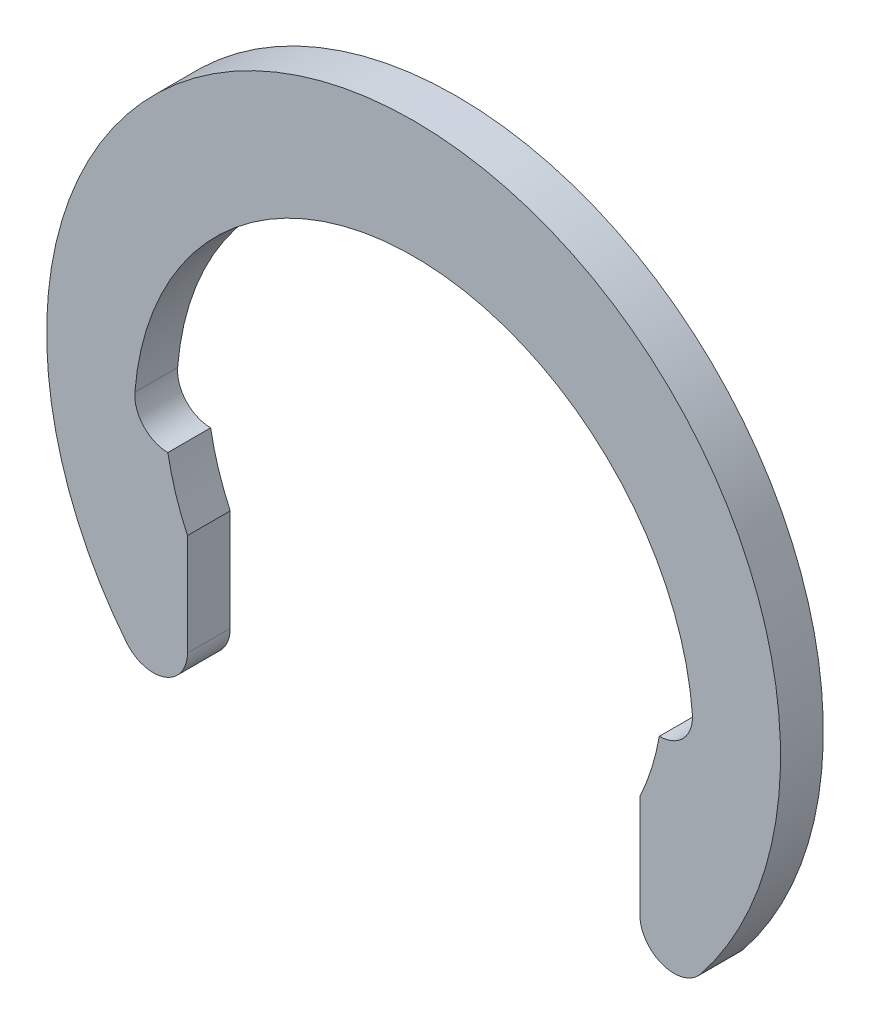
ISO-10303-21;
HEADER;
FILE_DESCRIPTION(('STEP AP214'),'2;1');
FILE_NAME('part.step','',(''),(''),'','','');
FILE_SCHEMA(('AUTOMOTIVE_DESIGN { 1 0 10303 214 1 1 1 1 }'));
ENDSEC;
DATA;
#1=APPLICATION_CONTEXT('core data for automotive mechanical design processes');
#2=APPLICATION_PROTOCOL_DEFINITION('international standard','automotive_design',2000,#1);
#3=PRODUCT_CONTEXT('',#1,'mechanical');
#4=PRODUCT('Part','Part','',(#3));
#5=PRODUCT_RELATED_PRODUCT_CATEGORY('part','',(#4));
#6=PRODUCT_DEFINITION_FORMATION('','',#4);
#7=PRODUCT_DEFINITION_CONTEXT('part definition',#1,'design');
#8=PRODUCT_DEFINITION('design','',#6,#7);
#9=PRODUCT_DEFINITION_SHAPE('','',#8);
#10=(LENGTH_UNIT() NAMED_UNIT(*) SI_UNIT(.MILLI.,.METRE.));
#11=(NAMED_UNIT(*) PLANE_ANGLE_UNIT() SI_UNIT($,.RADIAN.));
#12=(NAMED_UNIT(*) SI_UNIT($,.STERADIAN.) SOLID_ANGLE_UNIT());
#13=UNCERTAINTY_MEASURE_WITH_UNIT(LENGTH_MEASURE(1.E-05),#10,'distance_accuracy_value','');
#14=(GEOMETRIC_REPRESENTATION_CONTEXT(3) GLOBAL_UNCERTAINTY_ASSIGNED_CONTEXT((#13)) GLOBAL_UNIT_ASSIGNED_CONTEXT((#10,
#11,#12)) REPRESENTATION_CONTEXT('',''));
#15=CARTESIAN_POINT('',(0.,0.,0.));
#16=DIRECTION('',(0.,0.,1.));
#17=DIRECTION('',(1.,0.,0.));
#18=AXIS2_PLACEMENT_3D('',#15,#16,#17);
#19=CARTESIAN_POINT('',(0.,0.,-0.6));
#20=DIRECTION('',(0.,0.,1.));
#21=DIRECTION('',(1.,0.,0.));
#22=AXIS2_PLACEMENT_3D('',#19,#20,#21);
#23=CYLINDRICAL_SURFACE('',#22,3.5);
#24=CARTESIAN_POINT('',(0.,0.,0.));
#25=DIRECTION('',(0.,0.,-1.));
#26=DIRECTION('',(1.,0.,0.));
#27=AXIS2_PLACEMENT_3D('',#24,#25,#26);
#28=CIRCLE('',#27,3.5);
#29=CARTESIAN_POINT('',(-3.17207725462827,-1.47916391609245,0.));
#30=VERTEX_POINT('',#29);
#31=CARTESIAN_POINT('',(-3.44682713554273,-0.607768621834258,0.));
#32=VERTEX_POINT('',#31);
#33=EDGE_CURVE('E139',#30,#32,#28,.T.);
#34=ORIENTED_EDGE('',*,*,#33,.F.);
#35=DIRECTION('',(0.,0.,1.));
#36=VECTOR('',#35,1.);
#37=CARTESIAN_POINT('',(-3.17207725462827,-1.47916391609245,-0.6));
#38=LINE('',#37,#36);
#39=CARTESIAN_POINT('',(-3.17207725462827,-1.47916391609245,-0.6));
#40=VERTEX_POINT('',#39);
#41=EDGE_CURVE('E11',#40,#30,#38,.T.);
#42=ORIENTED_EDGE('',*,*,#41,.F.);
#43=CARTESIAN_POINT('',(0.,0.,-0.6));
#44=DIRECTION('',(0.,0.,-1.));
#45=DIRECTION('',(1.,0.,0.));
#46=AXIS2_PLACEMENT_3D('',#43,#44,#45);
#47=CIRCLE('',#46,3.5);
#48=CARTESIAN_POINT('',(-3.44682713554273,-0.607768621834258,-0.6));
#49=VERTEX_POINT('',#48);
#50=EDGE_CURVE('E165',#40,#49,#47,.T.);
#51=ORIENTED_EDGE('',*,*,#50,.T.);
#52=DIRECTION('',(0.,0.,1.));
#53=VECTOR('',#52,1.);
#54=CARTESIAN_POINT('',(-3.44682713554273,-0.607768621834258,-0.6));
#55=LINE('',#54,#53);
#56=EDGE_CURVE('E33',#49,#32,#55,.T.);
#57=ORIENTED_EDGE('',*,*,#56,.T.);
#58=EDGE_LOOP('',(#34,#42,#51,#57));
#59=FACE_BOUND('',#58,.T.);
#60=ADVANCED_FACE('F30',(#59),#23,.F.);
#61=CARTESIAN_POINT('',(-3.17207725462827,-1.47916391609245,-0.6));
#62=DIRECTION('',(1.,0.,0.));
#63=DIRECTION('',(0.,0.,-1.));
#64=AXIS2_PLACEMENT_3D('',#61,#62,#63);
#65=PLANE('',#64);
#66=DIRECTION('',(0.,1.,0.));
#67=VECTOR('',#66,1.);
#68=CARTESIAN_POINT('',(-3.17207725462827,-1.47916391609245,0.));
#69=LINE('',#68,#67);
#70=CARTESIAN_POINT('',(-3.17207725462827,-2.90581654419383,0.));
#71=VERTEX_POINT('',#70);
#72=EDGE_CURVE('E163',#71,#30,#69,.T.);
#73=ORIENTED_EDGE('',*,*,#72,.F.);
#74=DIRECTION('',(0.,0.,1.));
#75=VECTOR('',#74,1.);
#76=CARTESIAN_POINT('',(-3.17207725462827,-2.90581654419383,-0.6));
#77=LINE('',#76,#75);
#78=CARTESIAN_POINT('',(-3.17207725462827,-2.90581654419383,-0.6));
#79=VERTEX_POINT('',#78);
#80=EDGE_CURVE('E39',#79,#71,#77,.T.);
#81=ORIENTED_EDGE('',*,*,#80,.F.);
#82=DIRECTION('',(0.,1.,0.));
#83=VECTOR('',#82,1.);
#84=CARTESIAN_POINT('',(-3.17207725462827,-1.47916391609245,-0.6));
#85=LINE('',#84,#83);
#86=EDGE_CURVE('E129',#79,#40,#85,.T.);
#87=ORIENTED_EDGE('',*,*,#86,.T.);
#88=ORIENTED_EDGE('',*,*,#41,.T.);
#89=EDGE_LOOP('',(#73,#81,#87,#88));
#90=FACE_BOUND('',#89,.T.);
#91=ADVANCED_FACE('F181',(#90),#65,.T.);
#92=CARTESIAN_POINT('',(-3.65207725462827,-2.90581654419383,-0.6));
#93=DIRECTION('',(0.,0.,1.));
#94=DIRECTION('',(1.,0.,0.));
#95=AXIS2_PLACEMENT_3D('',#92,#93,#94);
#96=CYLINDRICAL_SURFACE('',#95,0.48);
#97=CARTESIAN_POINT('',(-3.65207725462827,-2.90581654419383,0.));
#98=DIRECTION('',(0.,0.,1.));
#99=DIRECTION('',(1.,0.,0.));
#100=AXIS2_PLACEMENT_3D('',#97,#98,#99);
#101=CIRCLE('',#100,0.48);
#102=CARTESIAN_POINT('',(-4.02768792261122,-3.20467541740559,0.));
#103=VERTEX_POINT('',#102);
#104=EDGE_CURVE('E116',#103,#71,#101,.T.);
#105=ORIENTED_EDGE('',*,*,#104,.F.);
#106=DIRECTION('',(0.,0.,1.));
#107=VECTOR('',#106,1.);
#108=CARTESIAN_POINT('',(-4.02768792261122,-3.20467541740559,-0.6));
#109=LINE('',#108,#107);
#110=CARTESIAN_POINT('',(-4.02768792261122,-3.20467541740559,-0.6));
#111=VERTEX_POINT('',#110);
#112=EDGE_CURVE('E111',#111,#103,#109,.T.);
#113=ORIENTED_EDGE('',*,*,#112,.F.);
#114=CARTESIAN_POINT('',(-3.65207725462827,-2.90581654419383,-0.6));
#115=DIRECTION('',(0.,0.,1.));
#116=DIRECTION('',(1.,0.,0.));
#117=AXIS2_PLACEMENT_3D('',#114,#115,#116);
#118=CIRCLE('',#117,0.48);
#119=EDGE_CURVE('E114',#111,#79,#118,.T.);
#120=ORIENTED_EDGE('',*,*,#119,.T.);
#121=ORIENTED_EDGE('',*,*,#80,.T.);
#122=EDGE_LOOP('',(#105,#113,#120,#121));
#123=FACE_BOUND('',#122,.T.);
#124=ADVANCED_FACE('F113',(#123),#96,.T.);
#125=CARTESIAN_POINT('',(0.,0.,-0.6));
#126=DIRECTION('',(0.,0.,1.));
#127=DIRECTION('',(1.,0.,0.));
#128=AXIS2_PLACEMENT_3D('',#125,#126,#127);
#129=CYLINDRICAL_SURFACE('',#128,5.14705882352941);
#130=CARTESIAN_POINT('',(0.,0.,0.));
#131=DIRECTION('',(0.,0.,1.));
#132=DIRECTION('',(1.,0.,0.));
#133=AXIS2_PLACEMENT_3D('',#130,#131,#132);
#134=CIRCLE('',#133,5.14705882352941);
#135=CARTESIAN_POINT('',(4.02768792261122,-3.20467541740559,0.));
#136=VERTEX_POINT('',#135);
#137=EDGE_CURVE('E160',#136,#103,#134,.T.);
#138=ORIENTED_EDGE('',*,*,#137,.F.);
#139=DIRECTION('',(0.,0.,1.));
#140=VECTOR('',#139,1.);
#141=CARTESIAN_POINT('',(4.02768792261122,-3.20467541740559,-0.6));
#142=LINE('',#141,#140);
#143=CARTESIAN_POINT('',(4.02768792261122,-3.20467541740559,-0.6));
#144=VERTEX_POINT('',#143);
#145=EDGE_CURVE('E121',#144,#136,#142,.T.);
#146=ORIENTED_EDGE('',*,*,#145,.F.);
#147=CARTESIAN_POINT('',(0.,0.,-0.6));
#148=DIRECTION('',(0.,0.,1.));
#149=DIRECTION('',(1.,0.,0.));
#150=AXIS2_PLACEMENT_3D('',#147,#148,#149);
#151=CIRCLE('',#150,5.14705882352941);
#152=EDGE_CURVE('E127',#144,#111,#151,.T.);
#153=ORIENTED_EDGE('',*,*,#152,.T.);
#154=ORIENTED_EDGE('',*,*,#112,.T.);
#155=EDGE_LOOP('',(#138,#146,#153,#154));
#156=FACE_BOUND('',#155,.T.);
#157=ADVANCED_FACE('F131',(#156),#129,.T.);
#158=CARTESIAN_POINT('',(3.65207725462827,-2.90581654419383,-0.6));
#159=DIRECTION('',(0.,0.,1.));
#160=DIRECTION('',(1.,0.,0.));
#161=AXIS2_PLACEMENT_3D('',#158,#159,#160);
#162=CYLINDRICAL_SURFACE('',#161,0.48);
#163=CARTESIAN_POINT('',(3.65207725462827,-2.90581654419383,0.));
#164=DIRECTION('',(0.,0.,1.));
#165=DIRECTION('',(1.,0.,0.));
#166=AXIS2_PLACEMENT_3D('',#163,#164,#165);
#167=CIRCLE('',#166,0.48);
#168=CARTESIAN_POINT('',(3.17207725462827,-2.90581654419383,0.));
#169=VERTEX_POINT('',#168);
#170=EDGE_CURVE('E157',#169,#136,#167,.T.);
#171=ORIENTED_EDGE('',*,*,#170,.F.);
#172=DIRECTION('',(0.,0.,1.));
#173=VECTOR('',#172,1.);
#174=CARTESIAN_POINT('',(3.17207725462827,-2.90581654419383,-0.6));
#175=LINE('',#174,#173);
#176=CARTESIAN_POINT('',(3.17207725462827,-2.90581654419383,-0.6));
#177=VERTEX_POINT('',#176);
#178=EDGE_CURVE('E169',#177,#169,#175,.T.);
#179=ORIENTED_EDGE('',*,*,#178,.F.);
#180=CARTESIAN_POINT('',(3.65207725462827,-2.90581654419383,-0.6));
#181=DIRECTION('',(0.,0.,1.));
#182=DIRECTION('',(1.,0.,0.));
#183=AXIS2_PLACEMENT_3D('',#180,#181,#182);
#184=CIRCLE('',#183,0.48);
#185=EDGE_CURVE('E132',#177,#144,#184,.T.);
#186=ORIENTED_EDGE('',*,*,#185,.T.);
#187=ORIENTED_EDGE('',*,*,#145,.T.);
#188=EDGE_LOOP('',(#171,#179,#186,#187));
#189=FACE_BOUND('',#188,.T.);
#190=ADVANCED_FACE('F194',(#189),#162,.T.);
#191=CARTESIAN_POINT('',(3.17207725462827,-1.47916391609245,-0.6));
#192=DIRECTION('',(-1.,0.,0.));
#193=DIRECTION('',(0.,0.,1.));
#194=AXIS2_PLACEMENT_3D('',#191,#192,#193);
#195=PLANE('',#194);
#196=DIRECTION('',(0.,-1.,0.));
#197=VECTOR('',#196,1.);
#198=CARTESIAN_POINT('',(3.17207725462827,-1.47916391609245,0.));
#199=LINE('',#198,#197);
#200=CARTESIAN_POINT('',(3.17207725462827,-1.47916391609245,0.));
#201=VERTEX_POINT('',#200);
#202=EDGE_CURVE('E154',#201,#169,#199,.T.);
#203=ORIENTED_EDGE('',*,*,#202,.F.);
#204=DIRECTION('',(0.,0.,1.));
#205=VECTOR('',#204,1.);
#206=CARTESIAN_POINT('',(3.17207725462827,-1.47916391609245,-0.6));
#207=LINE('',#206,#205);
#208=CARTESIAN_POINT('',(3.17207725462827,-1.47916391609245,-0.6));
#209=VERTEX_POINT('',#208);
#210=EDGE_CURVE('E171',#209,#201,#207,.T.);
#211=ORIENTED_EDGE('',*,*,#210,.F.);
#212=DIRECTION('',(0.,-1.,0.));
#213=VECTOR('',#212,1.);
#214=CARTESIAN_POINT('',(3.17207725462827,-1.47916391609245,-0.6));
#215=LINE('',#214,#213);
#216=EDGE_CURVE('E134',#209,#177,#215,.T.);
#217=ORIENTED_EDGE('',*,*,#216,.T.);
#218=ORIENTED_EDGE('',*,*,#178,.T.);
#219=EDGE_LOOP('',(#203,#211,#217,#218));
#220=FACE_BOUND('',#219,.T.);
#221=ADVANCED_FACE('F197',(#220),#195,.T.);
#222=CARTESIAN_POINT('',(0.,0.,-0.6));
#223=DIRECTION('',(0.,0.,1.));
#224=DIRECTION('',(1.,0.,0.));
#225=AXIS2_PLACEMENT_3D('',#222,#223,#224);
#226=CYLINDRICAL_SURFACE('',#225,3.5);
#227=CARTESIAN_POINT('',(0.,0.,0.));
#228=DIRECTION('',(0.,0.,-1.));
#229=DIRECTION('',(1.,0.,0.));
#230=AXIS2_PLACEMENT_3D('',#227,#228,#229);
#231=CIRCLE('',#230,3.5);
#232=CARTESIAN_POINT('',(3.44682713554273,-0.60776862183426,0.));
#233=VERTEX_POINT('',#232);
#234=EDGE_CURVE('E151',#233,#201,#231,.T.);
#235=ORIENTED_EDGE('',*,*,#234,.F.);
#236=DIRECTION('',(0.,0.,1.));
#237=VECTOR('',#236,1.);
#238=CARTESIAN_POINT('',(3.44682713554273,-0.60776862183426,-0.6));
#239=LINE('',#238,#237);
#240=CARTESIAN_POINT('',(3.44682713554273,-0.60776862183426,-0.6));
#241=VERTEX_POINT('',#240);
#242=EDGE_CURVE('E173',#241,#233,#239,.T.);
#243=ORIENTED_EDGE('',*,*,#242,.F.);
#244=CARTESIAN_POINT('',(0.,0.,-0.6));
#245=DIRECTION('',(0.,0.,-1.));
#246=DIRECTION('',(1.,0.,0.));
#247=AXIS2_PLACEMENT_3D('',#244,#245,#246);
#248=CIRCLE('',#247,3.5);
#249=EDGE_CURVE('E296',#241,#209,#248,.T.);
#250=ORIENTED_EDGE('',*,*,#249,.T.);
#251=ORIENTED_EDGE('',*,*,#210,.T.);
#252=EDGE_LOOP('',(#235,#243,#250,#251));
#253=FACE_BOUND('',#252,.T.);
#254=ADVANCED_FACE('F201',(#253),#226,.F.);
#255=CARTESIAN_POINT('',(3.44682713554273,-0.143075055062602,-0.6));
#256=DIRECTION('',(0.,0.,1.));
#257=DIRECTION('',(1.,0.,0.));
#258=AXIS2_PLACEMENT_3D('',#255,#256,#257);
#259=CYLINDRICAL_SURFACE('',#258,0.464693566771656);
#260=CARTESIAN_POINT('',(3.44682713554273,-0.143075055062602,0.));
#261=DIRECTION('',(0.,0.,-1.));
#262=DIRECTION('',(1.,0.,0.));
#263=AXIS2_PLACEMENT_3D('',#260,#261,#262);
#264=CIRCLE('',#263,0.464693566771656);
#265=CARTESIAN_POINT('',(3.9099973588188,-0.105479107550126,0.));
#266=VERTEX_POINT('',#265);
#267=EDGE_CURVE('E148',#266,#233,#264,.T.);
#268=ORIENTED_EDGE('',*,*,#267,.F.);
#269=DIRECTION('',(0.,0.,1.));
#270=VECTOR('',#269,1.);
#271=CARTESIAN_POINT('',(3.9099973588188,-0.105479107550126,-0.6));
#272=LINE('',#271,#270);
#273=CARTESIAN_POINT('',(3.9099973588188,-0.105479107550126,-0.6));
#274=VERTEX_POINT('',#273);
#275=EDGE_CURVE('E175',#274,#266,#272,.T.);
#276=ORIENTED_EDGE('',*,*,#275,.F.);
#277=CARTESIAN_POINT('',(3.44682713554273,-0.143075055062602,-0.6));
#278=DIRECTION('',(0.,0.,-1.));
#279=DIRECTION('',(1.,0.,0.));
#280=AXIS2_PLACEMENT_3D('',#277,#278,#279);
#281=CIRCLE('',#280,0.464693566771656);
#282=EDGE_CURVE('E292',#274,#241,#281,.T.);
#283=ORIENTED_EDGE('',*,*,#282,.T.);
#284=ORIENTED_EDGE('',*,*,#242,.T.);
#285=EDGE_LOOP('',(#268,#276,#283,#284));
#286=FACE_BOUND('',#285,.T.);
#287=ADVANCED_FACE('F205',(#286),#259,.F.);
#288=CARTESIAN_POINT('',(0.,-0.422857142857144,-0.6));
#289=DIRECTION('',(0.,0.,1.));
#290=DIRECTION('',(1.,0.,0.));
#291=AXIS2_PLACEMENT_3D('',#288,#289,#290);
#292=CYLINDRICAL_SURFACE('',#291,3.92285714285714);
#293=CARTESIAN_POINT('',(0.,-0.422857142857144,0.));
#294=DIRECTION('',(0.,0.,-1.));
#295=DIRECTION('',(1.,0.,0.));
#296=AXIS2_PLACEMENT_3D('',#293,#294,#295);
#297=CIRCLE('',#296,3.92285714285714);
#298=CARTESIAN_POINT('',(-3.9099973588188,-0.105479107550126,0.));
#299=VERTEX_POINT('',#298);
#300=EDGE_CURVE('E145',#299,#266,#297,.T.);
#301=ORIENTED_EDGE('',*,*,#300,.F.);
#302=DIRECTION('',(0.,0.,1.));
#303=VECTOR('',#302,1.);
#304=CARTESIAN_POINT('',(-3.9099973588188,-0.105479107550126,-0.6));
#305=LINE('',#304,#303);
#306=CARTESIAN_POINT('',(-3.9099973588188,-0.105479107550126,-0.6));
#307=VERTEX_POINT('',#306);
#308=EDGE_CURVE('E176',#307,#299,#305,.T.);
#309=ORIENTED_EDGE('',*,*,#308,.F.);
#310=CARTESIAN_POINT('',(0.,-0.422857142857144,-0.6));
#311=DIRECTION('',(0.,0.,-1.));
#312=DIRECTION('',(1.,0.,0.));
#313=AXIS2_PLACEMENT_3D('',#310,#311,#312);
#314=CIRCLE('',#313,3.92285714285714);
#315=EDGE_CURVE('E303',#307,#274,#314,.T.);
#316=ORIENTED_EDGE('',*,*,#315,.T.);
#317=ORIENTED_EDGE('',*,*,#275,.T.);
#318=EDGE_LOOP('',(#301,#309,#316,#317));
#319=FACE_BOUND('',#318,.T.);
#320=ADVANCED_FACE('F209',(#319),#292,.F.);
#321=CARTESIAN_POINT('',(-3.44682713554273,-0.143075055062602,-0.6));
#322=DIRECTION('',(0.,0.,1.));
#323=DIRECTION('',(1.,0.,0.));
#324=AXIS2_PLACEMENT_3D('',#321,#322,#323);
#325=CYLINDRICAL_SURFACE('',#324,0.464693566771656);
#326=CARTESIAN_POINT('',(-3.44682713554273,-0.143075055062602,0.));
#327=DIRECTION('',(0.,0.,-1.));
#328=DIRECTION('',(1.,0.,0.));
#329=AXIS2_PLACEMENT_3D('',#326,#327,#328);
#330=CIRCLE('',#329,0.464693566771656);
#331=EDGE_CURVE('E142',#32,#299,#330,.T.);
#332=ORIENTED_EDGE('',*,*,#331,.F.);
#333=ORIENTED_EDGE('',*,*,#56,.F.);
#334=CARTESIAN_POINT('',(-3.44682713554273,-0.143075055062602,-0.6));
#335=DIRECTION('',(0.,0.,-1.));
#336=DIRECTION('',(1.,0.,0.));
#337=AXIS2_PLACEMENT_3D('',#334,#335,#336);
#338=CIRCLE('',#337,0.464693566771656);
#339=EDGE_CURVE('E305',#49,#307,#338,.T.);
#340=ORIENTED_EDGE('',*,*,#339,.T.);
#341=ORIENTED_EDGE('',*,*,#308,.T.);
#342=EDGE_LOOP('',(#332,#333,#340,#341));
#343=FACE_BOUND('',#342,.T.);
#344=ADVANCED_FACE('F178',(#343),#325,.F.);
#345=CARTESIAN_POINT('',(0.,0.,-0.6));
#346=DIRECTION('',(0.,0.,1.));
#347=DIRECTION('',(1.,0.,0.));
#348=AXIS2_PLACEMENT_3D('',#345,#346,#347);
#349=PLANE('',#348);
#350=ORIENTED_EDGE('',*,*,#50,.F.);
#351=ORIENTED_EDGE('',*,*,#86,.F.);
#352=ORIENTED_EDGE('',*,*,#119,.F.);
#353=ORIENTED_EDGE('',*,*,#152,.F.);
#354=ORIENTED_EDGE('',*,*,#185,.F.);
#355=ORIENTED_EDGE('',*,*,#216,.F.);
#356=ORIENTED_EDGE('',*,*,#249,.F.);
#357=ORIENTED_EDGE('',*,*,#282,.F.);
#358=ORIENTED_EDGE('',*,*,#315,.F.);
#359=ORIENTED_EDGE('',*,*,#339,.F.);
#360=EDGE_LOOP('',(#350,#351,#352,#353,#354,#355,#356,#357,#358,#359));
#361=FACE_BOUND('',#360,.T.);
#362=ADVANCED_FACE('F125',(#361),#349,.F.);
#363=CARTESIAN_POINT('',(0.,0.,0.));
#364=DIRECTION('',(0.,0.,1.));
#365=DIRECTION('',(1.,0.,0.));
#366=AXIS2_PLACEMENT_3D('',#363,#364,#365);
#367=PLANE('',#366);
#368=ORIENTED_EDGE('',*,*,#33,.T.);
#369=ORIENTED_EDGE('',*,*,#331,.T.);
#370=ORIENTED_EDGE('',*,*,#300,.T.);
#371=ORIENTED_EDGE('',*,*,#267,.T.);
#372=ORIENTED_EDGE('',*,*,#234,.T.);
#373=ORIENTED_EDGE('',*,*,#202,.T.);
#374=ORIENTED_EDGE('',*,*,#170,.T.);
#375=ORIENTED_EDGE('',*,*,#137,.T.);
#376=ORIENTED_EDGE('',*,*,#104,.T.);
#377=ORIENTED_EDGE('',*,*,#72,.T.);
#378=EDGE_LOOP('',(#368,#369,#370,#371,#372,#373,#374,#375,#376,#377));
#379=FACE_BOUND('',#378,.T.);
#380=ADVANCED_FACE('F180',(#379),#367,.T.);
#381=CLOSED_SHELL('',(#60,#91,#124,#157,#190,#221,#254,#287,#320,#344,#362,#380));
#382=MANIFOLD_SOLID_BREP('B2',#381);
#383=ADVANCED_BREP_SHAPE_REPRESENTATION('',(#18,#382),#14);
#384=SHAPE_DEFINITION_REPRESENTATION(#9,#383);
ENDSEC;
END-ISO-10303-21;
